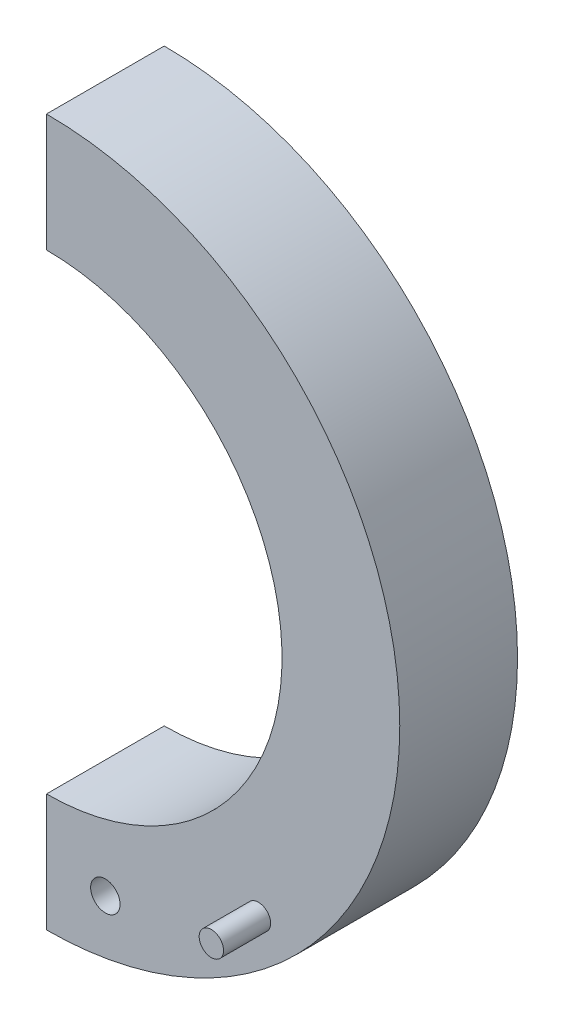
from build123d import *

# Parameters (mm, degrees)
FINGER_DEPTH             = 6.35
BOSS_EXTRUDE1_DEPTH      = 2.54
BOSS_EXTRUDE1_DEPTH_BACK = 8.89
SKETCH2_R                = 0.657759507
SKETCH3_R                = 0.79375
CUT_EXTRUDE1_DEPTH       = 29.369651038


with BuildPart() as part:
    # Sketch1 → Finger (new body)
    with BuildSketch(Plane.XY):
        with BuildLine():
            Line((0, 19.05), (0, 12.7))
            ThreePointArc((0, 12.7), (12.7, 0), (0, -12.7))
            Line((0, -12.7), (0, -19.05))
            ThreePointArc((0, -19.05), (19.05, 0), (0, 19.05))
        make_face()
    extrude(amount=FINGER_DEPTH)

    # Sketch2 → Boss-Extrude1 (add, two sides: drawn at the far end of the back side and taken through both)
    with BuildSketch(Plane.XY.offset(6.35).offset(-BOSS_EXTRUDE1_DEPTH_BACK)):
        with Locations((11.43, -12.7)):
            Circle(SKETCH2_R)
    extrude(amount=BOSS_EXTRUDE1_DEPTH + BOSS_EXTRUDE1_DEPTH_BACK)

    # Sketch3 → Cut-Extrude1 (cut, through all)
    with BuildSketch(Plane.XY.offset(6.35)):
        with Locations((3.175, -15.875)):
            Circle(SKETCH3_R)
    extrude(amount=-CUT_EXTRUDE1_DEPTH, mode=Mode.SUBTRACT)


solid = part.part
